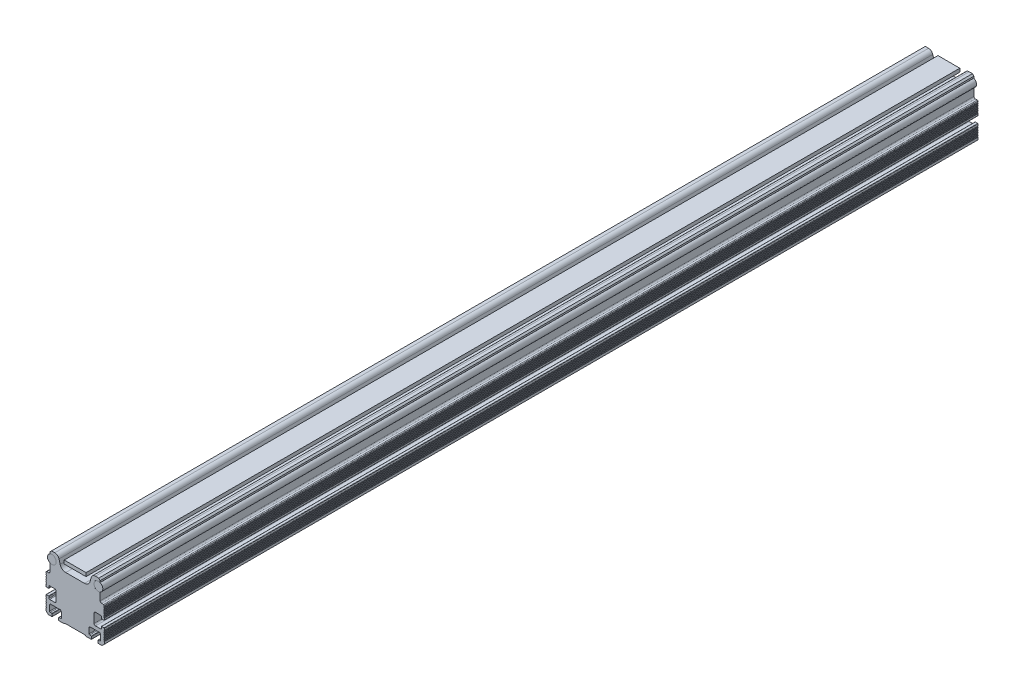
from build123d import *

# Parameters (mm, degrees)
EXTRUDE_1_DEPTH   = 600
SKETCH_1_W        = 15.000000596
SKETCH_1_H        = 2.399995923
EXTRUDE_1_2_DEPTH = 600
SKETCH_2_R        = 3.000000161
EXTRUDE_2_DEPTH   = 600
SKETCH_2_R_2      = 3
EXTRUDE_2_2_DEPTH = 600


with BuildPart() as part:
    # Sketch 1 → Extrude 1 (new body)
    with BuildSketch(Plane.XY):
        with BuildLine():
            Line((102.246418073, 106.878692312), (102.24641498, 107.207874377))
            ThreePointArc((102.24641498, 107.207874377), (102.266237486, 107.267635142), (102.317844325, 107.303704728))
            ThreePointArc((102.317844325, 107.303704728), (102.496415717, 107.543283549), (102.317844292, 107.782862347))
            ThreePointArc((102.317844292, 107.782862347), (102.266237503, 107.818932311), (102.246415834, 107.87869354))
            Line((102.246415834, 107.87869354), (102.246412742, 108.207870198))
            ThreePointArc((102.246412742, 108.207870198), (102.266233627, 108.267634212), (102.317842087, 108.303705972))
            ThreePointArc((102.317842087, 108.303705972), (102.496413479, 108.543284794), (102.317842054, 108.782863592))
            ThreePointArc((102.317842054, 108.782863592), (102.266235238, 108.818933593), (102.246413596, 108.878694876))
            Line((102.246413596, 108.878694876), (102.246410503, 109.207873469))
            ThreePointArc((102.246410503, 109.207873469), (102.266231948, 109.267636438), (102.31783985, 109.30370757))
            ThreePointArc((102.31783985, 109.30370757), (102.496410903, 109.543286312), (102.317839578, 109.78286485))
            ThreePointArc((102.317839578, 109.78286485), (102.266232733, 109.818934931), (102.246411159, 109.87869631))
            Line((102.246411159, 109.87869631), (102.246408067, 110.207876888))
            ThreePointArc((102.246408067, 110.207876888), (102.266230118, 110.267638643), (102.317837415, 110.303708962))
            ThreePointArc((102.317837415, 110.303708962), (102.496408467, 110.543287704), (102.317837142, 110.782866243))
            ThreePointArc((102.317837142, 110.782866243), (102.266230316, 110.818936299), (102.246408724, 110.878697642))
            Line((102.246408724, 110.878697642), (102.246405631, 111.207880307))
            ThreePointArc((102.246405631, 111.207880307), (102.266228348, 111.267640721), (102.317835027, 111.303710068))
            ThreePointArc((102.317835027, 111.303710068), (102.496406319, 111.543288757), (102.317834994, 111.782867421))
            ThreePointArc((102.317834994, 111.782867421), (102.266228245, 111.818937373), (102.246406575, 111.878698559))
            Line((102.246406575, 111.878698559), (102.246403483, 112.207876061))
            ThreePointArc((102.246403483, 112.207876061), (102.266224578, 112.267639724), (102.317832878, 112.303711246))
            ThreePointArc((102.317832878, 112.303711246), (102.496404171, 112.543289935), (102.317832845, 112.782868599))
            ThreePointArc((102.317832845, 112.782868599), (102.266226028, 112.818938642), (102.246404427, 112.878699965))
            Line((102.246404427, 112.878699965), (102.246404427, 114.093289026))
            ThreePointArc((102.246404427, 114.093289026), (102.304983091, 114.234710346), (102.446404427, 114.29328897))
            Line((102.446404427, 114.29328897), (104.046401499, 114.293287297))
            ThreePointArc((104.046401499, 114.293287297), (104.187824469, 114.234710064), (104.246404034, 114.09328806))
            Line((104.246404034, 114.09328806), (104.246404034, 112.993286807))
            ThreePointArc((104.246404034, 112.993286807), (104.392851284, 112.639735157), (104.746403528, 112.493289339))
            Line((104.746403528, 112.493289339), (108.246405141, 112.493286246))
            ThreePointArc((108.246405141, 112.493286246), (108.953511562, 112.786180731), (109.246404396, 113.493287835))
            Line((109.246404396, 113.493287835), (109.246408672, 119.593285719))
            ThreePointArc((109.246408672, 119.593285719), (108.953515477, 120.300396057), (108.246405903, 120.593291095))
            Line((108.246405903, 120.593291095), (104.746408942, 120.593289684))
            ThreePointArc((104.746408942, 120.593289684), (104.39285416, 120.446843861), (104.246407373, 120.093289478))
            Line((104.246407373, 120.093289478), (104.246408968, 118.993291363))
            ThreePointArc((104.246408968, 118.993291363), (104.187830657, 118.8518691), (104.046408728, 118.793289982))
            Line((104.046408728, 118.793289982), (102.446408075, 118.793288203))
            ThreePointArc((102.446408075, 118.793288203), (102.304986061, 118.851867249), (102.246407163, 118.993289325))
            Line((102.246407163, 118.993289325), (102.246403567, 120.207884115))
            ThreePointArc((102.246403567, 120.207884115), (102.266227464, 120.267642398), (102.317833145, 120.30371029))
            ThreePointArc((102.317833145, 120.30371029), (102.496404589, 120.543288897), (102.317833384, 120.782867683))
            ThreePointArc((102.317833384, 120.782867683), (102.266226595, 120.81893774), (102.246405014, 120.878699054))
            Line((102.246405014, 120.878699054), (102.246401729, 121.207872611))
            ThreePointArc((102.246401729, 121.207872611), (102.266221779, 121.267638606), (102.317831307, 121.30371166))
            ThreePointArc((102.317831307, 121.30371166), (102.49640275, 121.543290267), (102.317831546, 121.782869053))
            ThreePointArc((102.317831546, 121.782869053), (102.266224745, 121.818939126), (102.246403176, 121.878700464))
            Line((102.246403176, 121.878700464), (102.246399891, 122.207876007))
            ThreePointArc((102.246399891, 122.207876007), (102.266220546, 122.267640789), (102.317829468, 122.30371303))
            ThreePointArc((102.317829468, 122.30371303), (102.496400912, 122.543291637), (102.317829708, 122.782870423))
            ThreePointArc((102.317829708, 122.782870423), (102.266222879, 122.818940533), (102.246401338, 122.878701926))
            Line((102.246401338, 122.878701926), (102.246398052, 123.207879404))
            ThreePointArc((102.246398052, 123.207879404), (102.266219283, 123.26764319), (102.317827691, 123.303714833))
            ThreePointArc((102.317827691, 123.303714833), (102.49639848, 123.543293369), (102.31782763, 123.782871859))
            ThreePointArc((102.31782763, 123.782871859), (102.266220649, 123.818941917), (102.246399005, 123.878703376))
            Line((102.246399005, 123.878703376), (102.246396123, 124.207882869))
            ThreePointArc((102.246396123, 124.207882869), (102.266217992, 124.267645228), (102.317825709, 124.303715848))
            ThreePointArc((102.317825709, 124.303715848), (102.496397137, 124.543294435), (102.317825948, 124.782873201))
            ThreePointArc((102.317825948, 124.782873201), (102.266219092, 124.818943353), (102.246397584, 124.878704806))
            Line((102.246397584, 124.878704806), (102.246394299, 125.207886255))
            ThreePointArc((102.246394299, 125.207886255), (102.266216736, 125.267647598), (102.317823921, 125.303717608))
            ThreePointArc((102.317823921, 125.303717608), (102.496394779, 125.543296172), (102.317823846, 125.782874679))
            ThreePointArc((102.317823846, 125.782874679), (102.266216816, 125.818944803), (102.246395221, 125.87870636))
            Line((102.246395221, 125.87870636), (102.246392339, 126.207889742))
            ThreePointArc((102.246392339, 126.207889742), (102.266215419, 126.267649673), (102.317821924, 126.303718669))
            ThreePointArc((102.317821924, 126.303718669), (102.496393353, 126.543297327), (102.317822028, 126.782876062))
            ThreePointArc((102.317822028, 126.782876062), (102.266215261, 126.81894584), (102.24639342, 126.87870688))
            Line((102.24639342, 126.87870688), (102.246390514, 127.543303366))
            ThreePointArc((102.246390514, 127.543303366), (102.392839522, 127.896854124), (102.746391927, 128.043299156))
            Line((102.746391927, 128.043299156), (104.046389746, 128.043298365))
            ThreePointArc((104.046389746, 128.043298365), (104.753498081, 128.336190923), (105.046392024, 129.043298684))
            Line((105.046392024, 129.043298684), (105.04639188, 134.145025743))
            ThreePointArc((105.04639188, 134.145025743), (105.089596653, 134.227329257), (105.181875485, 134.238515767))
            ThreePointArc((105.181875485, 134.238515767), (106.79725931, 134.094307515), (108.251651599, 134.811945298))
            ThreePointArc((108.251651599, 134.811945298), (108.527426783, 134.870884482), (108.572851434, 135.149205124))
            ThreePointArc((108.572851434, 135.149205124), (109.246392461, 137.043298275), (108.572851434, 138.937391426))
            ThreePointArc((108.572851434, 138.937391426), (108.527426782, 139.215712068), (108.2516516, 139.274651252))
            ThreePointArc((108.2516516, 139.274651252), (106.797259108, 139.992289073), (105.181875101, 139.848080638))
            ThreePointArc((105.181875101, 139.848080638), (105.089595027, 139.859267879), (105.046391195, 139.941573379))
            Line((105.046391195, 139.941573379), (105.046392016, 141.043294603))
            Line((105.046392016, 141.043294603), (106.046394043, 142.04329663))
            Line((106.046394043, 142.04329663), (108.300813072, 142.04329663))
            ThreePointArc((108.300813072, 142.04329663), (110.12709927, 141.423357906), (111.198593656, 139.819754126))
            Line((111.198593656, 139.819754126), (111.951999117, 137.008014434))
            ThreePointArc((111.951999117, 137.008014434), (113.380657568, 134.869882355), (115.815700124, 134.043298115))
            Line((115.815700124, 134.043298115), (128.677078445, 134.043295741))
            ThreePointArc((128.677078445, 134.043295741), (131.112128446, 134.869880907), (132.540788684, 137.008020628))
            Line((132.540788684, 137.008020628), (133.294189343, 139.819759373))
            ThreePointArc((133.294189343, 139.819759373), (134.36568347, 141.423360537), (136.191967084, 142.043299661))
            Line((136.191967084, 142.043299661), (138.446398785, 142.043297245))
            Line((138.446398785, 142.043297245), (139.446385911, 141.043295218))
            Line((139.446385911, 141.043295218), (139.446392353, 139.941574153))
            ThreePointArc((139.446392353, 139.941574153), (139.403188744, 139.859268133), (139.310908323, 139.848080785))
            ThreePointArc((139.310908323, 139.848080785), (137.695525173, 139.992288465), (136.241133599, 139.274650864))
            ThreePointArc((136.241133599, 139.274650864), (135.96535745, 139.215712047), (135.919933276, 138.937390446))
            ThreePointArc((135.919933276, 138.937390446), (135.246392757, 137.043298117), (135.919933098, 135.149205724))
            ThreePointArc((135.919933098, 135.149205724), (135.965357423, 134.87088453), (136.241133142, 134.811945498))
            ThreePointArc((136.241133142, 134.811945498), (137.695524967, 134.094307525), (139.310908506, 134.238515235))
            ThreePointArc((139.310908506, 134.238515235), (139.403188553, 134.227327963), (139.446392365, 134.145022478))
            Line((139.446392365, 134.145022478), (139.446385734, 129.043300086))
            ThreePointArc((139.446385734, 129.043300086), (139.739279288, 128.336189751), (140.446389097, 128.043294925))
            Line((140.446389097, 128.043294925), (141.74639155, 128.043294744))
            ThreePointArc((141.74639155, 128.043294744), (142.09994288, 127.896847), (142.24638831, 127.543294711))
            Line((142.24638831, 127.543294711), (142.246388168, 126.878704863))
            ThreePointArc((142.246388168, 126.878704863), (142.226566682, 126.818943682), (142.174960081, 126.78287363))
            ThreePointArc((142.174960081, 126.78287363), (141.996378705, 126.543267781), (142.175006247, 126.303696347))
            ThreePointArc((142.175006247, 126.303696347), (142.226612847, 126.267626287), (142.24643437, 126.207865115))
            Line((142.24643437, 126.207865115), (142.246431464, 125.878686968))
            ThreePointArc((142.246431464, 125.878686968), (142.226610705, 125.818925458), (142.175004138, 125.782855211))
            ThreePointArc((142.175004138, 125.782855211), (141.996418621, 125.543293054), (142.174964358, 125.303701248))
            ThreePointArc((142.174964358, 125.303701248), (142.226571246, 125.267631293), (142.246392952, 125.207869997))
            Line((142.246392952, 125.207869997), (142.246390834, 124.878689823))
            ThreePointArc((142.246390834, 124.878689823), (142.226569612, 124.81892948), (142.174963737, 124.782859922))
            ThreePointArc((142.174963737, 124.782859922), (141.99639312, 124.543280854), (142.174964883, 124.30370264))
            ThreePointArc((142.174964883, 124.30370264), (142.22657177, 124.267632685), (142.246393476, 124.207871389))
            Line((142.246393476, 124.207871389), (142.246391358, 123.878689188))
            ThreePointArc((142.246391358, 123.878689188), (142.22656953, 123.81893006), (142.174964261, 123.782861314))
            ThreePointArc((142.174964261, 123.782861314), (141.996393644, 123.543282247), (142.174965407, 123.303704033))
            ThreePointArc((142.174965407, 123.303704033), (142.226572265, 123.267634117), (142.246394, 123.20787288))
            Line((142.246394, 123.20787288), (142.246391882, 122.878688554))
            ThreePointArc((142.246391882, 122.878688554), (142.226569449, 122.81893064), (142.174964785, 122.782862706))
            ThreePointArc((142.174964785, 122.782862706), (141.99639417, 122.543283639), (142.174965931, 122.303705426))
            ThreePointArc((142.174965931, 122.303705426), (142.226572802, 122.267635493), (142.246394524, 122.207874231))
            Line((142.246394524, 122.207874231), (142.246392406, 121.87868792))
            ThreePointArc((142.246392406, 121.87868792), (142.226569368, 121.818931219), (142.17496531, 121.782864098))
            ThreePointArc((142.17496531, 121.782864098), (141.996394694, 121.543285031), (142.174966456, 121.303706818))
            ThreePointArc((142.174966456, 121.303706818), (142.226573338, 121.267636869), (142.246395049, 121.207875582))
            Line((142.246395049, 121.207875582), (142.246392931, 120.878702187))
            ThreePointArc((142.246392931, 120.878702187), (142.22657374, 120.818937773), (142.174965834, 120.78286549))
            ThreePointArc((142.174965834, 120.78286549), (141.996395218, 120.543286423), (142.17496698, 120.30370821))
            ThreePointArc((142.17496698, 120.30370821), (142.226573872, 120.267638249), (142.246395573, 120.207876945))
            Line((142.246395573, 120.207876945), (142.246395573, 118.993289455))
            ThreePointArc((142.246395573, 118.993289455), (142.187818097, 118.851868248), (142.046397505, 118.793289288))
            Line((142.046397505, 118.793289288), (140.446393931, 118.793283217))
            ThreePointArc((140.446393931, 118.793283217), (140.304973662, 118.851862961), (140.246395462, 118.993283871))
            Line((140.246395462, 118.993283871), (140.246386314, 120.093288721))
            ThreePointArc((140.246386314, 120.093288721), (140.099937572, 120.44683585), (139.746388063, 120.593278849))
            Line((139.746388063, 120.593278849), (136.246388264, 120.593269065))
            ThreePointArc((136.246388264, 120.593269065), (135.539283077, 120.300374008), (135.246392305, 119.593267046))
            Line((135.246392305, 119.593267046), (135.246404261, 113.493264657))
            ThreePointArc((135.246404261, 113.493264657), (135.539300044, 112.7861583), (136.246408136, 112.493266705))
            Line((136.246408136, 112.493266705), (139.746406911, 112.493271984))
            ThreePointArc((139.746406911, 112.493271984), (140.099958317, 112.639717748), (140.246404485, 112.993268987))
            Line((140.246404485, 112.993268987), (140.246401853, 114.093272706))
            ThreePointArc((140.246401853, 114.093272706), (140.304980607, 114.234693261), (140.446400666, 114.293273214))
            Line((140.446400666, 114.293273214), (142.046397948, 114.293277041))
            ThreePointArc((142.046397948, 114.293277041), (142.18782292, 114.234701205), (142.246403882, 114.093278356))
            Line((142.246403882, 114.093278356), (142.246403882, 112.8786871))
            ThreePointArc((142.246403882, 112.8786871), (142.226582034, 112.818927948), (142.174976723, 112.782859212))
            ThreePointArc((142.174976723, 112.782859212), (141.996405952, 112.54328026), (142.174977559, 112.303701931))
            ThreePointArc((142.174977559, 112.303701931), (142.226584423, 112.267631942), (142.24640609, 112.207870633))
            Line((142.24640609, 112.207870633), (142.246403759, 111.878693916))
            ThreePointArc((142.246403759, 111.878693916), (142.226583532, 111.818931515), (142.1749766, 111.782860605))
            ThreePointArc((142.1749766, 111.782860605), (141.996405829, 111.543281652), (142.174977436, 111.303703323))
            ThreePointArc((142.174977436, 111.303703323), (142.2265843, 111.267633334), (142.246405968, 111.207872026))
            Line((142.246405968, 111.207872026), (142.246403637, 110.878693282))
            ThreePointArc((142.246403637, 110.878693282), (142.226582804, 110.818932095), (142.174976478, 110.782861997))
            ThreePointArc((142.174976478, 110.782861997), (141.996405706, 110.543283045), (142.174977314, 110.303704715))
            ThreePointArc((142.174977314, 110.303704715), (142.226584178, 110.267634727), (142.246405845, 110.207873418))
            Line((142.246405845, 110.207873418), (142.246403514, 109.878692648))
            ThreePointArc((142.246403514, 109.878692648), (142.226582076, 109.818932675), (142.174976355, 109.782863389))
            ThreePointArc((142.174976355, 109.782863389), (141.996405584, 109.543284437), (142.174977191, 109.303706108))
            ThreePointArc((142.174977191, 109.303706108), (142.226584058, 109.267636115), (142.246405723, 109.2078748))
            Line((142.246405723, 109.2078748), (142.246403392, 108.878692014))
            ThreePointArc((142.246403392, 108.878692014), (142.226581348, 108.818933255), (142.174976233, 108.782864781))
            ThreePointArc((142.174976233, 108.782864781), (141.996405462, 108.543285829), (142.174977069, 108.303707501))
            ThreePointArc((142.174977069, 108.303707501), (142.226583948, 108.267637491), (142.2464056, 108.207876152))
            Line((142.2464056, 108.207876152), (142.246403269, 107.87869883))
            ThreePointArc((142.246403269, 107.87869883), (142.226582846, 107.818936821), (142.174976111, 107.782866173))
            ThreePointArc((142.174976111, 107.782866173), (141.99640534, 107.543287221), (142.174976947, 107.303708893))
            ThreePointArc((142.174976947, 107.303708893), (142.226583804, 107.267638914), (142.246405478, 107.207877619))
            Line((142.246405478, 107.207877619), (142.246403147, 106.878698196))
            ThreePointArc((142.246403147, 106.878698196), (142.226582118, 106.818937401), (142.174975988, 106.782867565))
            ThreePointArc((142.174975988, 106.782867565), (141.996405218, 106.543288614), (142.174976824, 106.303710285))
            ThreePointArc((142.174976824, 106.303710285), (142.226583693, 106.267640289), (142.246405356, 106.20787897))
            Line((142.246405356, 106.20787897), (142.246405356, 104.543292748))
            Line((142.246405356, 104.543292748), (140.746409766, 103.043289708))
            Line((140.746409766, 103.043289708), (138.196403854, 103.043289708))
            ThreePointArc((138.196403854, 103.043289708), (138.054985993, 103.10187002), (137.99640921, 103.243289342))
            Line((137.99640921, 103.243289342), (137.996415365, 104.843290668))
            ThreePointArc((137.996415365, 104.843290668), (138.054993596, 104.984708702), (138.196412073, 105.043285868))
            Line((138.196412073, 105.043285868), (139.296410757, 105.043283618))
            ThreePointArc((139.296410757, 105.043283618), (139.649966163, 105.189730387), (139.796413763, 105.54328545))
            Line((139.796413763, 105.54328545), (139.796419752, 109.043283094))
            ThreePointArc((139.796419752, 109.043283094), (139.503526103, 109.75039358), (138.796416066, 110.043288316))
            Line((138.796416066, 110.043288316), (132.69642178, 110.043286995))
            ThreePointArc((132.69642178, 110.043286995), (131.989310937, 109.750395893), (131.696415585, 109.04328681))
            Line((131.696415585, 109.04328681), (131.696420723, 105.543285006))
            ThreePointArc((131.696420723, 105.543285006), (131.842867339, 105.189734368), (132.196418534, 105.043289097))
            Line((132.196418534, 105.043289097), (133.29642037, 105.043286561))
            ThreePointArc((133.29642037, 105.043286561), (133.437839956, 104.984707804), (133.496417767, 104.843287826))
            Line((133.496417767, 104.843287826), (133.496422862, 103.243284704))
            ThreePointArc((133.496422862, 103.243284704), (133.437842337, 103.101863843), (133.2964205, 103.043285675))
            Line((133.2964205, 103.043285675), (129.746413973, 103.043285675))
            Line((129.746413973, 103.043285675), (129.24642041, 103.543286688))
            Line((129.24642041, 103.543286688), (115.246421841, 103.543286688))
            Line((115.246421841, 103.543286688), (114.746413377, 103.043285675))
            Line((114.746413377, 103.043285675), (111.196420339, 103.043285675))
            ThreePointArc((111.196420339, 103.043285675), (111.0549995, 103.101864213), (110.996420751, 103.243284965))
            Line((110.996420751, 103.243284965), (110.996416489, 104.84328629))
            ThreePointArc((110.996416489, 104.84328629), (111.054996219, 104.984707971), (111.196418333, 105.043286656))
            Line((111.196418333, 105.043286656), (112.296421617, 105.043284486))
            ThreePointArc((112.296421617, 105.043284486), (112.649973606, 105.189732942), (112.796419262, 105.543286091))
            Line((112.796419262, 105.543286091), (112.796415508, 109.04328391))
            ThreePointArc((112.796415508, 109.04328391), (112.503523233, 109.750391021), (111.796416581, 110.043284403))
            Line((111.796416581, 110.043284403), (105.696412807, 110.043282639))
            ThreePointArc((105.696412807, 110.043282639), (104.989308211, 109.750387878), (104.69641626, 109.043282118))
            Line((104.69641626, 109.043282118), (104.696419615, 105.543280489))
            ThreePointArc((104.696419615, 105.543280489), (104.842866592, 105.189729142), (105.196418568, 105.043283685))
            Line((105.196418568, 105.043283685), (106.296418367, 105.04328123))
            ThreePointArc((106.296418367, 105.04328123), (106.4378398, 104.98470349), (106.496418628, 104.843282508))
            Line((106.496418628, 104.843282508), (106.49642099, 103.243279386))
            ThreePointArc((106.49642099, 103.243279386), (106.437840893, 103.101859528), (106.296420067, 103.043281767))
            Line((106.296420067, 103.043281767), (103.746420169, 103.043281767))
            Line((103.746420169, 103.043281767), (102.246417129, 104.543277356))
            Line((102.246417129, 104.543277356), (102.246417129, 106.207871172))
            ThreePointArc((102.246417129, 106.207871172), (102.266239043, 106.267633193), (102.317846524, 106.303703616))
            ThreePointArc((102.317846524, 106.303703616), (102.496417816, 106.543282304), (102.317846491, 106.782860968))
            ThreePointArc((102.317846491, 106.782860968), (102.266239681, 106.818931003), (102.246418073, 106.878692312))
        make_face()
    extrude(amount=EXTRUDE_1_DEPTH)


with BuildPart() as body_2:
    # Sketch 1 → Extrude 1 2 (new body)
    with BuildSketch(Plane.XY):
        with Locations((122.24638515, 139.743294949)):
            Rectangle(SKETCH_1_W, SKETCH_1_H)
    extrude(amount=EXTRUDE_1_2_DEPTH)


with BuildPart() as body_3:
    # Sketch 2 → Extrude 2 (new body)
    with BuildSketch(Plane.XY.offset(600)):
        with Locations((106.2463923, 137.043298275)):
            Circle(SKETCH_2_R)
    extrude(amount=-EXTRUDE_2_DEPTH)


with BuildPart() as body_4:
    # Sketch 2 → Extrude 2 2 (new body)
    with BuildSketch(Plane.XY.offset(600)):
        with Locations((138.246392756, 137.043297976)):
            Circle(SKETCH_2_R_2)
    extrude(amount=-EXTRUDE_2_2_DEPTH)


solid = Compound([part.part, body_2.part, body_3.part, body_4.part])
